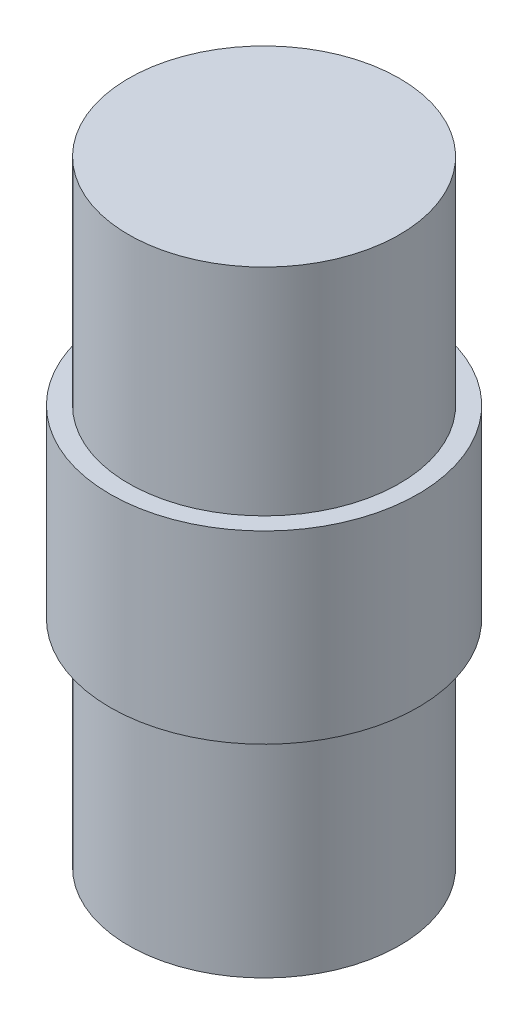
from build123d import *

# Parameters (mm, degrees)
SKETCH1_R      = 25
SKETCH1_R_2    = 22
EXTRUDE1_DEPTH = 15
SKETCH3_R      = 22
EXTRUDE2_DEPTH = 50


with BuildPart() as part:
    # Sketch1 → Extrude1 (new, symmetric)
    with BuildSketch(Plane(origin=(0, 0, 0), x_dir=(1, 0, 0), z_dir=(0, 1, 0))):
        with Locations(Location((0, 0, 0), (0, 0, 270))):
            Circle(SKETCH1_R)
        with Locations(Location((0, 0, 0), (0, 0, 270))):
            Circle(SKETCH1_R_2, mode=Mode.SUBTRACT)
    extrude(amount=EXTRUDE1_DEPTH, both=True)

    # Sketch3 → Extrude2 (add, symmetric)
    with BuildSketch(Plane(origin=(0, 0, 0), x_dir=(1, 0, 0), z_dir=(0, 1, 0))):
        with Locations(Location((0, 0, 0), (0, 0, 90))):
            Circle(SKETCH3_R)
    extrude(amount=EXTRUDE2_DEPTH, both=True)


solid = part.part
